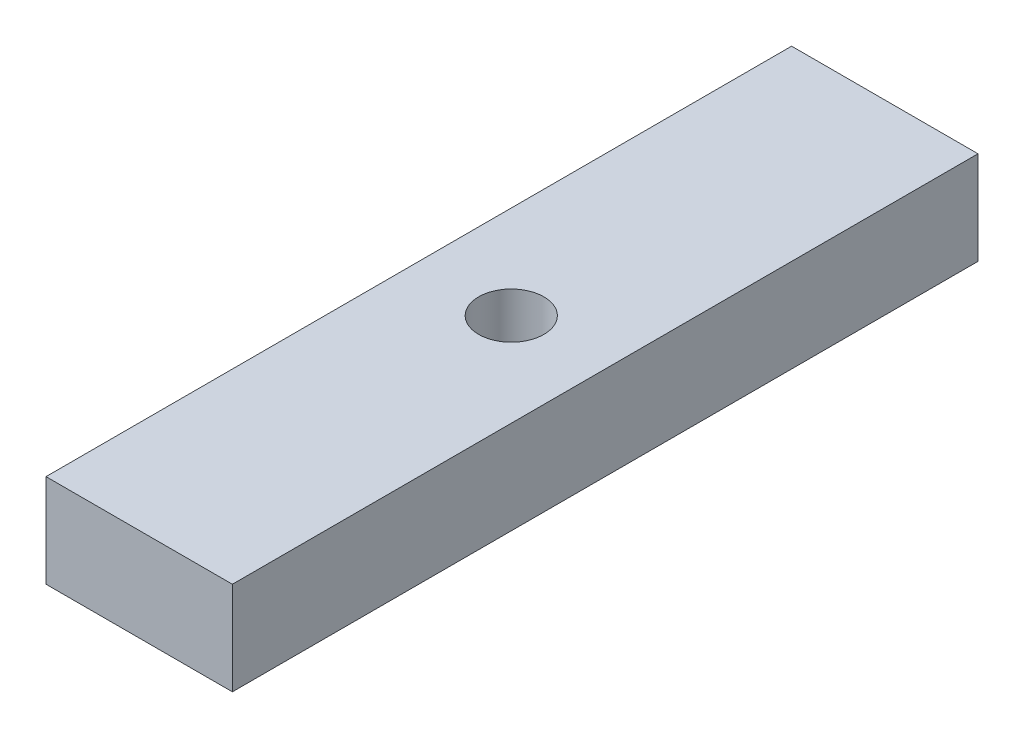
from build123d import *

# Parameters (mm, degrees)
ESQUISSE1_W             = 20
ESQUISSE1_H             = 10
EXTRUSION1_DEPTH        = 80
ESQUISSE2_R             = 3.5
ENL_V_MAT_EXTRU_1_DEPTH = 10


with BuildPart() as part:
    # Esquisse1 → Extrusion1 (new body)
    with BuildSketch(Plane.XY):
        with Locations((10, 5)):
            Rectangle(ESQUISSE1_W, ESQUISSE1_H)
    extrude(amount=-EXTRUSION1_DEPTH)

    # Esquisse2 → Enl_v. mat.-Extru.1 (cut)
    with BuildSketch(Plane(origin=(0, 10, 0), x_dir=(-1, 0, 0), z_dir=(0, 1, 0))):
        with Locations(Location((-10, -39.922163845, 0), (0, 0, 90))):
            Circle(ESQUISSE2_R)
    extrude(amount=-ENL_V_MAT_EXTRU_1_DEPTH, mode=Mode.SUBTRACT)


solid = part.part
